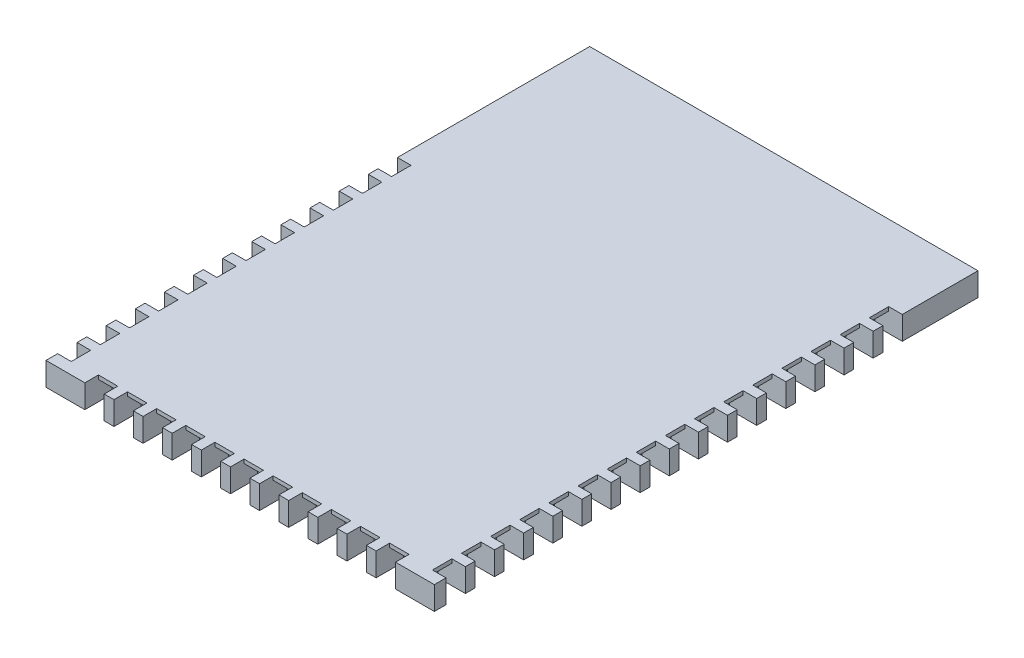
from build123d import *

# Parameters (mm, degrees)
SKETCH1_W           = 10
SKETCH1_H           = 14
BOSS_EXTRUDE1_DEPTH = 0.6
SKETCH2_W           = 0.5
SKETCH2_H           = 0.6
CUT_EXTRUDE1_DEPTH  = 0.7
SKETCH3_W           = 0.5
SKETCH3_H           = 0.6
CUT_EXTRUDE2_DEPTH  = 0.7
SKETCH4_W           = 0.5
SKETCH4_H           = 0.6
CUT_EXTRUDE3_DEPTH  = 0.7
SKETCH6_W           = 8.75
SKETCH6_H           = 0.1
BOSS_EXTRUDE2_DEPTH = 0.35
SKETCH7_W           = 11.75
SKETCH7_H           = 0.1
BOSS_EXTRUDE3_DEPTH = 0.35
SKETCH8_W           = 8
SKETCH8_H           = 0.1
BOSS_EXTRUDE4_DEPTH = 0.35


with BuildPart() as part:
    # Sketch1 → Boss-Extrude1 (new body)
    with BuildSketch(Plane(origin=(0, 0, 0), x_dir=(1, 0, 0), z_dir=(0, 1, 0))):
        with Locations((5, 7)):
            Rectangle(SKETCH1_W, SKETCH1_H)
    extrude(amount=BOSS_EXTRUDE1_DEPTH)

    # Sketch2 → Cut-Extrude1 (cut)
    with BuildSketch(Plane(origin=(10, 0, 0), x_dir=(0, 0, -1), z_dir=(1, 0, 0))):
        with Locations((0.55, 0.3)):
            Rectangle(SKETCH2_W, SKETCH2_H)
        with Locations((1.3, 0.3)):
            Rectangle(SKETCH2_W, SKETCH2_H)
        with Locations((2.05, 0.3)):
            Rectangle(SKETCH2_W, SKETCH2_H)
        with Locations((2.8, 0.3)):
            Rectangle(SKETCH2_W, SKETCH2_H)
        with Locations((3.55, 0.3)):
            Rectangle(SKETCH2_W, SKETCH2_H)
        with Locations((4.3, 0.3)):
            Rectangle(SKETCH2_W, SKETCH2_H)
        with Locations((5.05, 0.3)):
            Rectangle(SKETCH2_W, SKETCH2_H)
        with Locations((5.8, 0.3)):
            Rectangle(SKETCH2_W, SKETCH2_H)
        with Locations((6.55, 0.3)):
            Rectangle(SKETCH2_W, SKETCH2_H)
        with Locations((7.3, 0.3)):
            Rectangle(SKETCH2_W, SKETCH2_H)
        with Locations((8.05, 0.3)):
            Rectangle(SKETCH2_W, SKETCH2_H)
        with Locations((8.8, 0.3)):
            Rectangle(SKETCH2_W, SKETCH2_H)
        with Locations((9.55, 0.3)):
            Rectangle(SKETCH2_W, SKETCH2_H)
        with Locations((10.3, 0.3)):
            Rectangle(SKETCH2_W, SKETCH2_H)
        with Locations((11.05, 0.3)):
            Rectangle(SKETCH2_W, SKETCH2_H)
        with Locations((11.8, 0.3)):
            Rectangle(SKETCH2_W, SKETCH2_H)
    extrude(amount=-CUT_EXTRUDE1_DEPTH, mode=Mode.SUBTRACT)

    # Sketch3 → Cut-Extrude2 (cut)
    with BuildSketch(Plane.ZY):
        with Locations((-0.55, 0.3)):
            Rectangle(SKETCH3_W, SKETCH3_H)
        with Locations((-1.3, 0.3)):
            Rectangle(SKETCH3_W, SKETCH3_H)
        with Locations((-2.05, 0.3)):
            Rectangle(SKETCH3_W, SKETCH3_H)
        with Locations((-2.8, 0.3)):
            Rectangle(SKETCH3_W, SKETCH3_H)
        with Locations((-3.55, 0.3)):
            Rectangle(SKETCH3_W, SKETCH3_H)
        with Locations((-4.3, 0.3)):
            Rectangle(SKETCH3_W, SKETCH3_H)
        with Locations((-5.05, 0.3)):
            Rectangle(SKETCH3_W, SKETCH3_H)
        with Locations((-5.8, 0.3)):
            Rectangle(SKETCH3_W, SKETCH3_H)
        with Locations((-6.55, 0.3)):
            Rectangle(SKETCH3_W, SKETCH3_H)
        with Locations((-7.3, 0.3)):
            Rectangle(SKETCH3_W, SKETCH3_H)
        with Locations((-8.05, 0.3)):
            Rectangle(SKETCH3_W, SKETCH3_H)
        with Locations((-8.8, 0.3)):
            Rectangle(SKETCH3_W, SKETCH3_H)
    extrude(amount=-CUT_EXTRUDE2_DEPTH, mode=Mode.SUBTRACT)

    # Sketch4 → Cut-Extrude3 (cut)
    with BuildSketch(Plane.XY):
        with Locations((1.25, 0.3)):
            Rectangle(SKETCH4_W, SKETCH4_H)
        with Locations((2, 0.3)):
            Rectangle(SKETCH4_W, SKETCH4_H)
        with Locations((2.75, 0.3)):
            Rectangle(SKETCH4_W, SKETCH4_H)
        with Locations((3.5, 0.3)):
            Rectangle(SKETCH4_W, SKETCH4_H)
        with Locations((4.25, 0.3)):
            Rectangle(SKETCH4_W, SKETCH4_H)
        with Locations((5, 0.3)):
            Rectangle(SKETCH4_W, SKETCH4_H)
        with Locations((5.75, 0.3)):
            Rectangle(SKETCH4_W, SKETCH4_H)
        with Locations((6.5, 0.3)):
            Rectangle(SKETCH4_W, SKETCH4_H)
        with Locations((7.25, 0.3)):
            Rectangle(SKETCH4_W, SKETCH4_H)
        with Locations((8, 0.3)):
            Rectangle(SKETCH4_W, SKETCH4_H)
        with Locations((8.75, 0.3)):
            Rectangle(SKETCH4_W, SKETCH4_H)
    extrude(amount=-CUT_EXTRUDE3_DEPTH, mode=Mode.SUBTRACT)

    # Sketch6 → Boss-Extrude2 (add)
    with BuildSketch(Plane.ZY.offset(-0.7)):
        with Locations((-4.675, 0.55)):
            Rectangle(SKETCH6_W, SKETCH6_H)
    extrude(amount=BOSS_EXTRUDE2_DEPTH)

    # Sketch7 → Boss-Extrude3 (add)
    with BuildSketch(Plane(origin=(9.3, 0, 0), x_dir=(0, 0, -1), z_dir=(1, 0, 0))):
        with Locations((6.175, 0.55)):
            Rectangle(SKETCH7_W, SKETCH7_H)
    extrude(amount=BOSS_EXTRUDE3_DEPTH)

    # Sketch8 → Boss-Extrude4 (add)
    with BuildSketch(Plane.XY.offset(-0.7)):
        with Locations((5, 0.55)):
            Rectangle(SKETCH8_W, SKETCH8_H)
    extrude(amount=BOSS_EXTRUDE4_DEPTH)


solid = part.part
